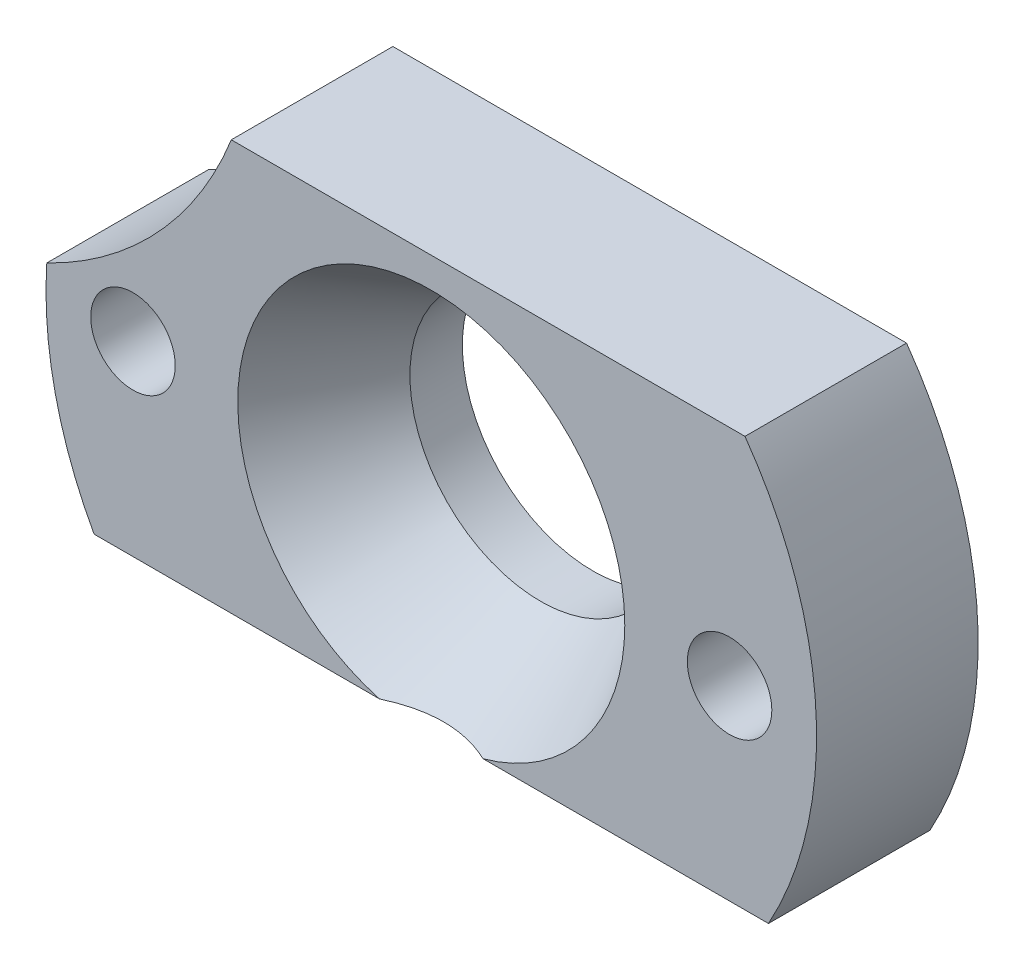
ISO-10303-21;
HEADER;
FILE_DESCRIPTION(('STEP AP214'),'2;1');
FILE_NAME('part.step','',(''),(''),'','','');
FILE_SCHEMA(('AUTOMOTIVE_DESIGN { 1 0 10303 214 1 1 1 1 }'));
ENDSEC;
DATA;
#1=APPLICATION_CONTEXT('core data for automotive mechanical design processes');
#2=APPLICATION_PROTOCOL_DEFINITION('international standard','automotive_design',2000,#1);
#3=PRODUCT_CONTEXT('',#1,'mechanical');
#4=PRODUCT('Part','Part','',(#3));
#5=PRODUCT_RELATED_PRODUCT_CATEGORY('part','',(#4));
#6=PRODUCT_DEFINITION_FORMATION('','',#4);
#7=PRODUCT_DEFINITION_CONTEXT('part definition',#1,'design');
#8=PRODUCT_DEFINITION('design','',#6,#7);
#9=PRODUCT_DEFINITION_SHAPE('','',#8);
#10=(LENGTH_UNIT() NAMED_UNIT(*) SI_UNIT(.MILLI.,.METRE.));
#11=(NAMED_UNIT(*) PLANE_ANGLE_UNIT() SI_UNIT($,.RADIAN.));
#12=(NAMED_UNIT(*) SI_UNIT($,.STERADIAN.) SOLID_ANGLE_UNIT());
#13=UNCERTAINTY_MEASURE_WITH_UNIT(LENGTH_MEASURE(1.E-05),#10,'distance_accuracy_value','');
#14=(GEOMETRIC_REPRESENTATION_CONTEXT(3) GLOBAL_UNCERTAINTY_ASSIGNED_CONTEXT((#13)) GLOBAL_UNIT_ASSIGNED_CONTEXT((#10,
#11,#12)) REPRESENTATION_CONTEXT('',''));
#15=CARTESIAN_POINT('',(0.,0.,0.));
#16=DIRECTION('',(0.,0.,1.));
#17=DIRECTION('',(1.,0.,0.));
#18=AXIS2_PLACEMENT_3D('',#15,#16,#17);
#19=CARTESIAN_POINT('',(0.,0.,6.5));
#20=DIRECTION('',(0.,0.,-1.));
#21=DIRECTION('',(-1.,0.,0.));
#22=AXIS2_PLACEMENT_3D('',#19,#20,#21);
#23=CYLINDRICAL_SURFACE('',#22,15.5);
#24=CARTESIAN_POINT('',(0.,0.,0.));
#25=DIRECTION('',(0.,0.,1.));
#26=DIRECTION('',(1.,0.,0.));
#27=AXIS2_PLACEMENT_3D('',#24,#25,#26);
#28=CIRCLE('',#27,15.5);
#29=CARTESIAN_POINT('',(13.5646599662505,-7.5,0.));
#30=VERTEX_POINT('',#29);
#31=CARTESIAN_POINT('',(12.619429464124,9.,0.));
#32=VERTEX_POINT('',#31);
#33=EDGE_CURVE('E146',#30,#32,#28,.T.);
#34=ORIENTED_EDGE('',*,*,#33,.T.);
#35=DIRECTION('',(0.,0.,-1.));
#36=VECTOR('',#35,1.);
#37=CARTESIAN_POINT('',(12.619429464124,9.,6.5));
#38=LINE('',#37,#36);
#39=CARTESIAN_POINT('',(12.619429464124,9.,6.5));
#40=VERTEX_POINT('',#39);
#41=EDGE_CURVE('E63',#40,#32,#38,.T.);
#42=ORIENTED_EDGE('',*,*,#41,.F.);
#43=CARTESIAN_POINT('',(0.,0.,6.5));
#44=DIRECTION('',(0.,0.,1.));
#45=DIRECTION('',(1.,0.,0.));
#46=AXIS2_PLACEMENT_3D('',#43,#44,#45);
#47=CIRCLE('',#46,15.5);
#48=CARTESIAN_POINT('',(13.5646599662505,-7.5,6.5));
#49=VERTEX_POINT('',#48);
#50=EDGE_CURVE('E143',#49,#40,#47,.T.);
#51=ORIENTED_EDGE('',*,*,#50,.F.);
#52=DIRECTION('',(0.,0.,-1.));
#53=VECTOR('',#52,1.);
#54=CARTESIAN_POINT('',(13.5646599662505,-7.5,6.5));
#55=LINE('',#54,#53);
#56=EDGE_CURVE('E150',#49,#30,#55,.T.);
#57=ORIENTED_EDGE('',*,*,#56,.T.);
#58=EDGE_LOOP('',(#34,#42,#51,#57));
#59=FACE_BOUND('',#58,.T.);
#60=ADVANCED_FACE('F50',(#59),#23,.T.);
#61=CARTESIAN_POINT('',(12.619429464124,9.,6.5));
#62=DIRECTION('',(0.,-1.,0.));
#63=DIRECTION('',(0.,0.,-1.));
#64=AXIS2_PLACEMENT_3D('',#61,#62,#63);
#65=PLANE('',#64);
#66=DIRECTION('',(-1.,0.,0.));
#67=VECTOR('',#66,1.);
#68=CARTESIAN_POINT('',(12.619429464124,9.,0.));
#69=LINE('',#68,#67);
#70=CARTESIAN_POINT('',(-8.04471426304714,9.,0.));
#71=VERTEX_POINT('',#70);
#72=EDGE_CURVE('E139',#32,#71,#69,.T.);
#73=ORIENTED_EDGE('',*,*,#72,.T.);
#74=DIRECTION('',(0.,0.,-1.));
#75=VECTOR('',#74,1.);
#76=CARTESIAN_POINT('',(-8.04471426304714,9.,6.76881236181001));
#77=LINE('',#76,#75);
#78=CARTESIAN_POINT('',(-8.04471426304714,9.,6.5));
#79=VERTEX_POINT('',#78);
#80=EDGE_CURVE('E73',#71,#79,#77,.F.);
#81=ORIENTED_EDGE('',*,*,#80,.T.);
#82=DIRECTION('',(-1.,0.,0.));
#83=VECTOR('',#82,1.);
#84=CARTESIAN_POINT('',(12.619429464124,9.,6.5));
#85=LINE('',#84,#83);
#86=EDGE_CURVE('E165',#40,#79,#85,.T.);
#87=ORIENTED_EDGE('',*,*,#86,.F.);
#88=ORIENTED_EDGE('',*,*,#41,.T.);
#89=EDGE_LOOP('',(#73,#81,#87,#88));
#90=FACE_BOUND('',#89,.T.);
#91=ADVANCED_FACE('F163',(#90),#65,.F.);
#92=CARTESIAN_POINT('',(0.,0.,6.5));
#93=DIRECTION('',(0.,0.,-1.));
#94=DIRECTION('',(-1.,0.,0.));
#95=AXIS2_PLACEMENT_3D('',#92,#93,#94);
#96=CYLINDRICAL_SURFACE('',#95,15.5);
#97=CARTESIAN_POINT('',(0.,0.,6.5));
#98=DIRECTION('',(0.,0.,1.));
#99=DIRECTION('',(-1.,0.,0.));
#100=AXIS2_PLACEMENT_3D('',#97,#98,#99);
#101=CIRCLE('',#100,15.5);
#102=CARTESIAN_POINT('',(-15.4679036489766,0.996973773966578,6.5));
#103=VERTEX_POINT('',#102);
#104=CARTESIAN_POINT('',(-13.5646599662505,-7.5,6.5));
#105=VERTEX_POINT('',#104);
#106=EDGE_CURVE('E131',#103,#105,#101,.T.);
#107=ORIENTED_EDGE('',*,*,#106,.F.);
#108=DIRECTION('',(0.,0.,-1.));
#109=VECTOR('',#108,1.);
#110=CARTESIAN_POINT('',(-15.4679036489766,0.996973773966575,3.38440618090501));
#111=LINE('',#110,#109);
#112=CARTESIAN_POINT('',(-15.4679036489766,0.996973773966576,0.));
#113=VERTEX_POINT('',#112);
#114=EDGE_CURVE('E117',#103,#113,#111,.T.);
#115=ORIENTED_EDGE('',*,*,#114,.T.);
#116=CARTESIAN_POINT('',(0.,0.,0.));
#117=DIRECTION('',(0.,0.,1.));
#118=DIRECTION('',(-1.,0.,0.));
#119=AXIS2_PLACEMENT_3D('',#116,#117,#118);
#120=CIRCLE('',#119,15.5);
#121=CARTESIAN_POINT('',(-13.5646599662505,-7.5,0.));
#122=VERTEX_POINT('',#121);
#123=EDGE_CURVE('E129',#113,#122,#120,.T.);
#124=ORIENTED_EDGE('',*,*,#123,.T.);
#125=DIRECTION('',(0.,0.,-1.));
#126=VECTOR('',#125,1.);
#127=CARTESIAN_POINT('',(-13.5646599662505,-7.5,6.5));
#128=LINE('',#127,#126);
#129=EDGE_CURVE('E154',#105,#122,#128,.T.);
#130=ORIENTED_EDGE('',*,*,#129,.F.);
#131=EDGE_LOOP('',(#107,#115,#124,#130));
#132=FACE_BOUND('',#131,.T.);
#133=ADVANCED_FACE('F127',(#132),#96,.T.);
#134=CARTESIAN_POINT('',(13.5646599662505,-7.5,6.5));
#135=DIRECTION('',(0.,1.,0.));
#136=DIRECTION('',(0.,0.,1.));
#137=AXIS2_PLACEMENT_3D('',#134,#135,#136);
#138=PLANE('',#137);
#139=DIRECTION('',(1.,0.,0.));
#140=VECTOR('',#139,1.);
#141=CARTESIAN_POINT('',(13.5646599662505,-7.5,6.5));
#142=LINE('',#141,#140);
#143=CARTESIAN_POINT('',(2.08554405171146,-7.5,6.5));
#144=VERTEX_POINT('',#143);
#145=EDGE_CURVE('E180',#144,#49,#142,.T.);
#146=ORIENTED_EDGE('',*,*,#145,.F.);
#147=CARTESIAN_POINT('',(-9.21194169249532,-7.5,13.5917085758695));
#148=CARTESIAN_POINT('',(-9.06047941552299,-7.5,13.3882877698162));
#149=CARTESIAN_POINT('',(-8.908074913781,-7.5,13.1855631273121));
#150=CARTESIAN_POINT('',(-8.6010856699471,-7.5,12.7817501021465));
#151=CARTESIAN_POINT('',(-8.44650077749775,-7.5,12.5806618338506));
#152=CARTESIAN_POINT('',(-8.13457170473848,-7.5,12.1800030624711));
#153=CARTESIAN_POINT('',(-7.97722272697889,-7.5,11.9804362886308));
#154=CARTESIAN_POINT('',(-7.65970712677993,-7.5,11.5835608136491));
#155=CARTESIAN_POINT('',(-7.49954056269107,-7.5,11.3862520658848));
#156=CARTESIAN_POINT('',(-7.16995385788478,-7.5,10.9870293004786));
#157=CARTESIAN_POINT('',(-7.00041097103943,-7.5,10.7852164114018));
#158=CARTESIAN_POINT('',(-6.65726564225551,-7.5,10.3850739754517));
#159=CARTESIAN_POINT('',(-6.48366331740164,-7.5,10.1867443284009));
#160=CARTESIAN_POINT('',(-6.13182565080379,-7.5,9.79450099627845));
#161=CARTESIAN_POINT('',(-5.95359399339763,-7.5,9.60058401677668));
#162=CARTESIAN_POINT('',(-5.5915205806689,-7.5,9.21807750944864));
#163=CARTESIAN_POINT('',(-5.4076793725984,-7.5,9.02948746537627));
#164=CARTESIAN_POINT('',(-5.01530862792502,-7.5,8.64122545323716));
#165=CARTESIAN_POINT('',(-4.80610461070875,-7.5,8.44223078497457));
#166=CARTESIAN_POINT('',(-4.37779892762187,-7.5,8.05485752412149));
#167=CARTESIAN_POINT('',(-4.15869207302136,-7.5,7.86648461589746));
#168=CARTESIAN_POINT('',(-3.7108345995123,-7.5,7.50617651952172));
#169=CARTESIAN_POINT('',(-3.48220164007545,-7.5,7.33409641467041));
#170=CARTESIAN_POINT('',(-3.01123044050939,-7.5,7.01003912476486));
#171=CARTESIAN_POINT('',(-2.76891083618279,-7.5,6.85803550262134));
#172=CARTESIAN_POINT('',(-2.36536975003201,-7.5,6.63553071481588));
#173=CARTESIAN_POINT('',(-2.20900588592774,-7.5,6.55623677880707));
#174=CARTESIAN_POINT('',(-1.88992950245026,-7.5,6.41055136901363));
#175=CARTESIAN_POINT('',(-1.72720581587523,-7.5,6.34418393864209));
#176=CARTESIAN_POINT('',(-1.43921227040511,-7.5,6.24249860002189));
#177=CARTESIAN_POINT('',(-1.31520812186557,-7.5,6.20359451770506));
#178=CARTESIAN_POINT('',(-1.06455647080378,-7.5,6.13557173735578));
#179=CARTESIAN_POINT('',(-0.937909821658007,-7.5,6.10644993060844));
#180=CARTESIAN_POINT('',(-0.682733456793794,-7.5,6.05897889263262));
#181=CARTESIAN_POINT('',(-0.554205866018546,-7.5,6.04061834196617));
#182=CARTESIAN_POINT('',(-0.29602698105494,-7.5,6.01531323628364));
#183=CARTESIAN_POINT('',(-0.166375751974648,-7.5,6.00836802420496));
#184=CARTESIAN_POINT('',(0.0934241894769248,-7.5,6.00616786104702));
#185=CARTESIAN_POINT('',(0.223573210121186,-7.5,6.01094874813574));
#186=CARTESIAN_POINT('',(0.482919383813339,-7.5,6.03208130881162));
#187=CARTESIAN_POINT('',(0.612116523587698,-7.5,6.04843314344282));
#188=CARTESIAN_POINT('',(0.868680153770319,-7.5,6.09208752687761));
#189=CARTESIAN_POINT('',(0.996045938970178,-7.5,6.11939418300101));
#190=CARTESIAN_POINT('',(1.2482002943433,-7.5,6.18401568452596));
#191=CARTESIAN_POINT('',(1.37298849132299,-7.5,6.22133196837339));
#192=CARTESIAN_POINT('',(1.67452126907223,-7.5,6.32351405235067));
#193=CARTESIAN_POINT('',(1.84962055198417,-7.5,6.39324456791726));
#194=CARTESIAN_POINT('',(2.19293257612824,-7.5,6.54796632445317));
#195=CARTESIAN_POINT('',(2.3611412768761,-7.5,6.63296636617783));
#196=CARTESIAN_POINT('',(2.69245784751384,-7.5,6.81612679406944));
#197=CARTESIAN_POINT('',(2.85549456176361,-7.5,6.91441473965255));
#198=CARTESIAN_POINT('',(3.17503668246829,-7.5,7.12087174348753));
#199=CARTESIAN_POINT('',(3.33154445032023,-7.5,7.2290371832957));
#200=CARTESIAN_POINT('',(3.72931882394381,-7.5,7.5193533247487));
#201=CARTESIAN_POINT('',(3.96617284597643,-7.5,7.70753517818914));
#202=CARTESIAN_POINT('',(4.42793647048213,-7.5,8.09811994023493));
#203=CARTESIAN_POINT('',(4.65283751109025,-7.5,8.30053280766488));
#204=CARTESIAN_POINT('',(5.09364584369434,-7.5,8.71650698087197));
#205=CARTESIAN_POINT('',(5.30951552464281,-7.5,8.93010789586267));
#206=CARTESIAN_POINT('',(5.73310824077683,-7.5,9.3650792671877));
#207=CARTESIAN_POINT('',(5.94083345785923,-7.5,9.58644761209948));
#208=CARTESIAN_POINT('',(6.33570827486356,-7.5,10.0199257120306));
#209=CARTESIAN_POINT('',(6.52329545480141,-7.5,10.2316386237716));
#210=CARTESIAN_POINT('',(6.89363206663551,-7.5,10.6592780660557));
#211=CARTESIAN_POINT('',(7.07638104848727,-7.5,10.8752049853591));
#212=CARTESIAN_POINT('',(7.43615643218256,-7.5,11.3085205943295));
#213=CARTESIAN_POINT('',(7.61321933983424,-7.5,11.5258790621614));
#214=CARTESIAN_POINT('',(7.96382484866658,-7.5,11.96333356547));
#215=CARTESIAN_POINT('',(8.13736828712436,-7.5,12.1834289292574));
#216=CARTESIAN_POINT('',(8.3094531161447,-7.5,12.4046427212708));
#217=B_SPLINE_CURVE_WITH_KNOTS('',3,(#147,#148,#149,#150,#151,#152,#153,#154,#155,#156,#157,
#158,#159,#160,#161,#162,#163,#164,#165,#166,#167,#168,#169,#170,#171,#172,#173,#174,#175,#176,
#177,#178,#179,#180,#181,#182,#183,#184,#185,#186,#187,#188,#189,#190,#191,#192,#193,#194,#195,
#196,#197,#198,#199,#200,#201,#202,#203,#204,#205,#206,#207,#208,#209,#210,#211,#212,#213,#214,
#215,#216),.UNSPECIFIED.,.F.,.F.,(4,2,2,2,2,2,2,2,2,2,2,2,2,2,2,2,2,2,2,2,2,2,2,2,2,2,2,2,2,2,2,
2,2,2,4),(0.,0.760850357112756,1.52175344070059,2.28414192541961,3.04651464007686,
3.83720222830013,4.62786703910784,5.41792078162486,6.20789769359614,7.0738103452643,
7.94018208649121,8.79793269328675,9.65454229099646,10.1800416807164,10.7065093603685,
11.0960554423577,11.4854776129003,11.8744894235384,12.2634788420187,12.6536585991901,
13.0438437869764,13.4341754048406,13.8245631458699,14.3890340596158,14.9538313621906,
15.5244968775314,16.0949541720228,17.0016380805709,17.9089629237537,18.819751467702,
19.7302943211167,20.5787972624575,21.4273788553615,22.2683907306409,23.1092001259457),.UNSPECIFIED.);
#218=CARTESIAN_POINT('',(-2.08554405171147,-7.5,6.5));
#219=VERTEX_POINT('',#218);
#220=EDGE_CURVE('E13',#144,#219,#217,.F.);
#221=ORIENTED_EDGE('',*,*,#220,.T.);
#222=EDGE_CURVE('E155',#105,#219,#142,.T.);
#223=ORIENTED_EDGE('',*,*,#222,.F.);
#224=ORIENTED_EDGE('',*,*,#129,.T.);
#225=DIRECTION('',(1.,0.,0.));
#226=VECTOR('',#225,1.);
#227=CARTESIAN_POINT('',(13.5646599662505,-7.5,0.));
#228=LINE('',#227,#226);
#229=EDGE_CURVE('E137',#122,#30,#228,.T.);
#230=ORIENTED_EDGE('',*,*,#229,.T.);
#231=ORIENTED_EDGE('',*,*,#56,.F.);
#232=EDGE_LOOP('',(#146,#221,#223,#224,#230,#231));
#233=FACE_BOUND('',#232,.T.);
#234=ADVANCED_FACE('F214',(#233),#138,.F.);
#235=CARTESIAN_POINT('',(0.,0.,6.5));
#236=DIRECTION('',(0.,0.,1.));
#237=DIRECTION('',(1.,0.,0.));
#238=AXIS2_PLACEMENT_3D('',#235,#236,#237);
#239=PLANE('',#238);
#240=CARTESIAN_POINT('',(-22.,14.5,6.5));
#241=DIRECTION('',(0.,0.,1.));
#242=DIRECTION('',(1.,0.,0.));
#243=AXIS2_PLACEMENT_3D('',#240,#241,#242);
#244=CIRCLE('',#243,15.);
#245=EDGE_CURVE('E123',#103,#79,#244,.T.);
#246=ORIENTED_EDGE('',*,*,#245,.F.);
#247=ORIENTED_EDGE('',*,*,#106,.T.);
#248=ORIENTED_EDGE('',*,*,#222,.T.);
#249=CARTESIAN_POINT('',(0.,0.,6.5));
#250=DIRECTION('',(0.,0.,1.));
#251=DIRECTION('',(1.,0.,0.));
#252=AXIS2_PLACEMENT_3D('',#249,#250,#251);
#253=CIRCLE('',#252,7.78456768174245);
#254=EDGE_CURVE('E82',#144,#219,#253,.T.);
#255=ORIENTED_EDGE('',*,*,#254,.F.);
#256=ORIENTED_EDGE('',*,*,#145,.T.);
#257=ORIENTED_EDGE('',*,*,#50,.T.);
#258=ORIENTED_EDGE('',*,*,#86,.T.);
#259=EDGE_LOOP('',(#246,#247,#248,#255,#256,#257,#258));
#260=FACE_BOUND('',#259,.T.);
#261=CARTESIAN_POINT('',(-12.,0.,6.5));
#262=DIRECTION('',(0.,0.,1.));
#263=DIRECTION('',(1.,0.,0.));
#264=AXIS2_PLACEMENT_3D('',#261,#262,#263);
#265=CIRCLE('',#264,1.69999999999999);
#266=CARTESIAN_POINT('',(-10.3,0.,6.5));
#267=VERTEX_POINT('',#266);
#268=EDGE_CURVE('E192',#267,#267,#265,.T.);
#269=ORIENTED_EDGE('',*,*,#268,.F.);
#270=EDGE_LOOP('',(#269));
#271=FACE_BOUND('',#270,.T.);
#272=CARTESIAN_POINT('',(12.,0.,6.5));
#273=DIRECTION('',(0.,0.,1.));
#274=DIRECTION('',(1.,0.,0.));
#275=AXIS2_PLACEMENT_3D('',#272,#273,#274);
#276=CIRCLE('',#275,1.69999999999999);
#277=CARTESIAN_POINT('',(13.7,0.,6.5));
#278=VERTEX_POINT('',#277);
#279=EDGE_CURVE('E174',#278,#278,#276,.T.);
#280=ORIENTED_EDGE('',*,*,#279,.F.);
#281=EDGE_LOOP('',(#280));
#282=FACE_BOUND('',#281,.T.);
#283=ADVANCED_FACE('F209',(#260,#271,#282),#239,.T.);
#284=CARTESIAN_POINT('',(0.,0.,0.));
#285=DIRECTION('',(0.,0.,1.));
#286=DIRECTION('',(1.,0.,0.));
#287=AXIS2_PLACEMENT_3D('',#284,#285,#286);
#288=PLANE('',#287);
#289=CARTESIAN_POINT('',(0.,0.,0.));
#290=DIRECTION('',(0.,0.,1.));
#291=DIRECTION('',(1.,0.,0.));
#292=AXIS2_PLACEMENT_3D('',#289,#290,#291);
#293=CIRCLE('',#292,5.25);
#294=CARTESIAN_POINT('',(5.25,0.,0.));
#295=VERTEX_POINT('',#294);
#296=EDGE_CURVE('E196',#295,#295,#293,.T.);
#297=ORIENTED_EDGE('',*,*,#296,.T.);
#298=EDGE_LOOP('',(#297));
#299=FACE_BOUND('',#298,.T.);
#300=CARTESIAN_POINT('',(-12.,0.,0.));
#301=DIRECTION('',(0.,0.,1.));
#302=DIRECTION('',(1.,0.,0.));
#303=AXIS2_PLACEMENT_3D('',#300,#301,#302);
#304=CIRCLE('',#303,1.7);
#305=CARTESIAN_POINT('',(-10.3,0.,0.));
#306=VERTEX_POINT('',#305);
#307=EDGE_CURVE('E188',#306,#306,#304,.T.);
#308=ORIENTED_EDGE('',*,*,#307,.T.);
#309=EDGE_LOOP('',(#308));
#310=FACE_BOUND('',#309,.T.);
#311=CARTESIAN_POINT('',(12.,0.,0.));
#312=DIRECTION('',(0.,0.,1.));
#313=DIRECTION('',(1.,0.,0.));
#314=AXIS2_PLACEMENT_3D('',#311,#312,#313);
#315=CIRCLE('',#314,1.7);
#316=CARTESIAN_POINT('',(13.7,0.,0.));
#317=VERTEX_POINT('',#316);
#318=EDGE_CURVE('E171',#317,#317,#315,.T.);
#319=ORIENTED_EDGE('',*,*,#318,.T.);
#320=EDGE_LOOP('',(#319));
#321=FACE_BOUND('',#320,.T.);
#322=ORIENTED_EDGE('',*,*,#123,.F.);
#323=CARTESIAN_POINT('',(-22.,14.5,0.));
#324=DIRECTION('',(0.,0.,-1.));
#325=DIRECTION('',(1.,0.,0.));
#326=AXIS2_PLACEMENT_3D('',#323,#324,#325);
#327=CIRCLE('',#326,15.);
#328=EDGE_CURVE('E114',#71,#113,#327,.T.);
#329=ORIENTED_EDGE('',*,*,#328,.F.);
#330=ORIENTED_EDGE('',*,*,#72,.F.);
#331=ORIENTED_EDGE('',*,*,#33,.F.);
#332=ORIENTED_EDGE('',*,*,#229,.F.);
#333=EDGE_LOOP('',(#322,#329,#330,#331,#332));
#334=FACE_BOUND('',#333,.T.);
#335=ADVANCED_FACE('F135',(#299,#310,#321,#334),#288,.F.);
#336=CARTESIAN_POINT('',(12.,0.,6.5));
#337=DIRECTION('',(0.,0.,1.));
#338=DIRECTION('',(1.,0.,0.));
#339=AXIS2_PLACEMENT_3D('',#336,#337,#338);
#340=CYLINDRICAL_SURFACE('',#339,1.69999999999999);
#341=ORIENTED_EDGE('',*,*,#318,.F.);
#342=EDGE_LOOP('',(#341));
#343=FACE_BOUND('',#342,.T.);
#344=ORIENTED_EDGE('',*,*,#279,.T.);
#345=EDGE_LOOP('',(#344));
#346=FACE_BOUND('',#345,.T.);
#347=ADVANCED_FACE('F227',(#343,#346),#340,.F.);
#348=CARTESIAN_POINT('',(-12.,0.,6.5));
#349=DIRECTION('',(0.,0.,1.));
#350=DIRECTION('',(1.,0.,0.));
#351=AXIS2_PLACEMENT_3D('',#348,#349,#350);
#352=CYLINDRICAL_SURFACE('',#351,1.69999999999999);
#353=ORIENTED_EDGE('',*,*,#307,.F.);
#354=EDGE_LOOP('',(#353));
#355=FACE_BOUND('',#354,.T.);
#356=ORIENTED_EDGE('',*,*,#268,.T.);
#357=EDGE_LOOP('',(#356));
#358=FACE_BOUND('',#357,.T.);
#359=ADVANCED_FACE('F219',(#355,#358),#352,.F.);
#360=CARTESIAN_POINT('',(0.,0.,6.5));
#361=DIRECTION('',(0.,0.,1.));
#362=DIRECTION('',(1.,0.,0.));
#363=AXIS2_PLACEMENT_3D('',#360,#361,#362);
#364=CONICAL_SURFACE('',#363,7.78456768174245,0.523598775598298);
#365=CARTESIAN_POINT('',(0.,0.,2.11));
#366=DIRECTION('',(0.,0.,1.));
#367=DIRECTION('',(1.,0.,0.));
#368=AXIS2_PLACEMENT_3D('',#365,#366,#367);
#369=CIRCLE('',#368,5.25);
#370=CARTESIAN_POINT('',(5.25,0.,2.11));
#371=VERTEX_POINT('',#370);
#372=EDGE_CURVE('E200',#371,#371,#369,.T.);
#373=ORIENTED_EDGE('',*,*,#372,.F.);
#374=EDGE_LOOP('',(#373));
#375=FACE_BOUND('',#374,.T.);
#376=ORIENTED_EDGE('',*,*,#254,.T.);
#377=ORIENTED_EDGE('',*,*,#220,.F.);
#378=EDGE_LOOP('',(#376,#377));
#379=FACE_BOUND('',#378,.T.);
#380=ADVANCED_FACE('F216',(#375,#379),#364,.F.);
#381=CARTESIAN_POINT('',(0.,0.,6.5));
#382=DIRECTION('',(0.,0.,1.));
#383=DIRECTION('',(1.,0.,0.));
#384=AXIS2_PLACEMENT_3D('',#381,#382,#383);
#385=CYLINDRICAL_SURFACE('',#384,5.25);
#386=ORIENTED_EDGE('',*,*,#296,.F.);
#387=EDGE_LOOP('',(#386));
#388=FACE_BOUND('',#387,.T.);
#389=ORIENTED_EDGE('',*,*,#372,.T.);
#390=EDGE_LOOP('',(#389));
#391=FACE_BOUND('',#390,.T.);
#392=ADVANCED_FACE('F218',(#388,#391),#385,.F.);
#393=CARTESIAN_POINT('',(-22.,14.5,6.76881236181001));
#394=DIRECTION('',(0.,0.,-1.));
#395=DIRECTION('',(-1.,0.,0.));
#396=AXIS2_PLACEMENT_3D('',#393,#394,#395);
#397=CYLINDRICAL_SURFACE('',#396,15.);
#398=ORIENTED_EDGE('',*,*,#328,.T.);
#399=ORIENTED_EDGE('',*,*,#114,.F.);
#400=ORIENTED_EDGE('',*,*,#245,.T.);
#401=ORIENTED_EDGE('',*,*,#80,.F.);
#402=EDGE_LOOP('',(#398,#399,#400,#401));
#403=FACE_BOUND('',#402,.T.);
#404=ADVANCED_FACE('F116',(#403),#397,.F.);
#405=CLOSED_SHELL('',(#60,#91,#133,#234,#283,#335,#347,#359,#380,#392,#404));
#406=MANIFOLD_SOLID_BREP('B2',#405);
#407=ADVANCED_BREP_SHAPE_REPRESENTATION('',(#18,#406),#14);
#408=SHAPE_DEFINITION_REPRESENTATION(#9,#407);
ENDSEC;
END-ISO-10303-21;
